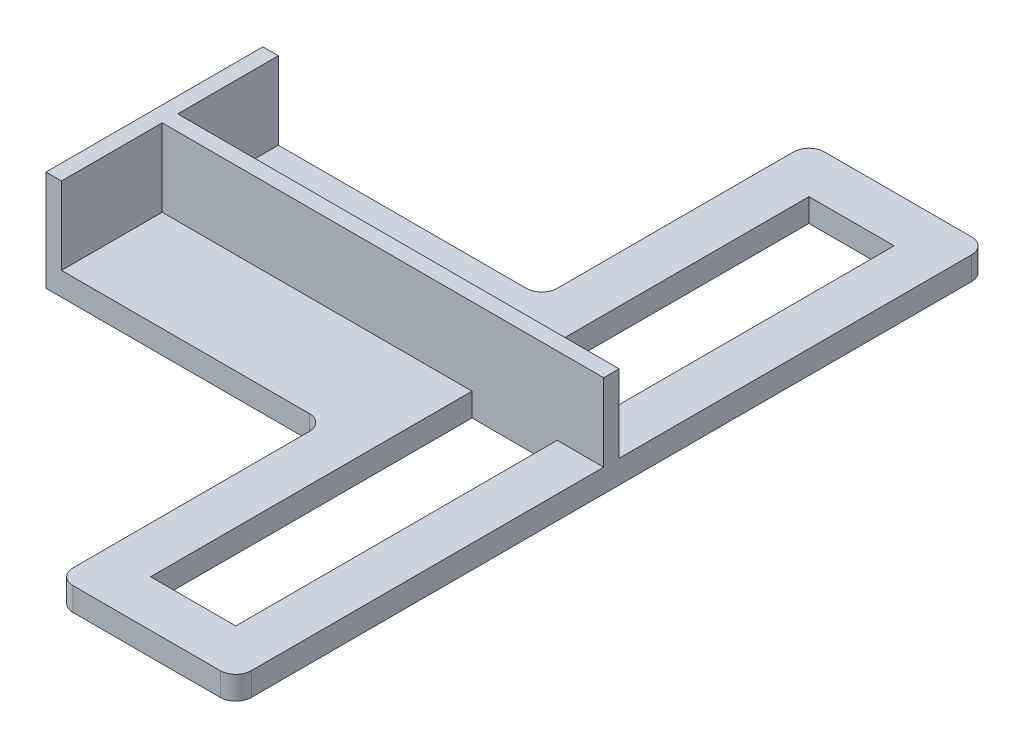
from build123d import *

# Parameters (mm, degrees)
SKETCH1_W           = 11
SKETCH1_H           = 41.5
BOSS_EXTRUDE1_DEPTH = 3
FILLET1_R           = 2
BOSS_EXTRUDE2_DEPTH = 10


with BuildPart() as part:
    # Sketch1 → Boss-Extrude1 (new body)
    with BuildSketch(Plane(origin=(0, 0, 0), x_dir=(1, 0, 0), z_dir=(0, 1, 0))):
        Polygon((-47.5, 7.75), (-47.5, 35.75), (-11.5, 35.75), (-11.5, 70.25), (11.501073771, 70.25), (11.501073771, -26.75), (-11.5, -26.75), (-11.5, 7.75), align=None)
        with Locations((0, 43.5)):
            Rectangle(SKETCH1_W, SKETCH1_H, mode=Mode.SUBTRACT)
        Rectangle(SKETCH1_W, SKETCH1_H, mode=Mode.SUBTRACT)
    extrude(amount=BOSS_EXTRUDE1_DEPTH)

    # Fillet1
    fillet1_edges = [part.edges().sort_by_distance(p)[0] for p in [
        (11.501073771, 1.5, -70.25),
        (11.501073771, 1.5, 26.75),
        (-11.5, 1.5, 26.75),
        (-11.5, 1.5, -7.75),
        (-11.5, 1.5, -35.75),
        (-11.5, 1.5, -70.25),
    ]]
    fillet(fillet1_edges, radius=FILLET1_R)

    # Sketch2 → Boss-Extrude2 (add)
    with BuildSketch(Plane(origin=(0, 3, 0), x_dir=(1, 0, 0), z_dir=(0, 1, 0))):
        Polygon((11.501073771, 22.75), (-45.5, 22.75), (-45.5, 35.75), (-47.5, 35.75), (-47.5, 7.75), (-45.5, 7.75), (-45.5, 20.75), (11.501073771, 20.75), align=None)
    extrude(amount=BOSS_EXTRUDE2_DEPTH)


solid = part.part
